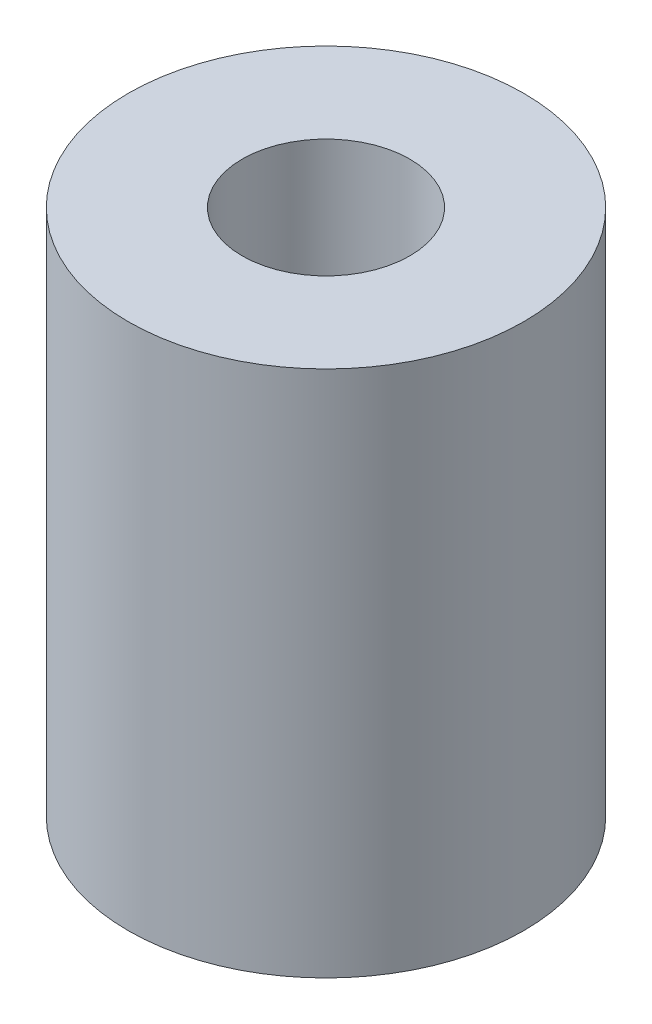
from build123d import *

# Parameters (mm, degrees)
SKETCH1_R           = 4.7625
BOSS_EXTRUDE1_DEPTH = 12.7
SKETCH2_R           = 2.0193
CUT_EXTRUDE1_DEPTH  = 15.375423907


with BuildPart() as part:
    # Sketch1 → Boss-Extrude1 (new body)
    with BuildSketch(Plane(origin=(0, 0, 0), x_dir=(1, 0, 0), z_dir=(0, 1, 0))):
        with Locations(Location((0, 0, 0), (0, 0, 270))):
            Circle(SKETCH1_R)
    extrude(amount=BOSS_EXTRUDE1_DEPTH)

    # Sketch2 → Cut-Extrude1 (cut, through all)
    with BuildSketch(Plane(origin=(0, 12.7, 0), x_dir=(1, 0, 0), z_dir=(0, 1, 0))):
        with Locations(Location((0, 0, 0), (0, 0, 270))):
            Circle(SKETCH2_R)
    extrude(amount=-CUT_EXTRUDE1_DEPTH, mode=Mode.SUBTRACT)


solid = part.part
